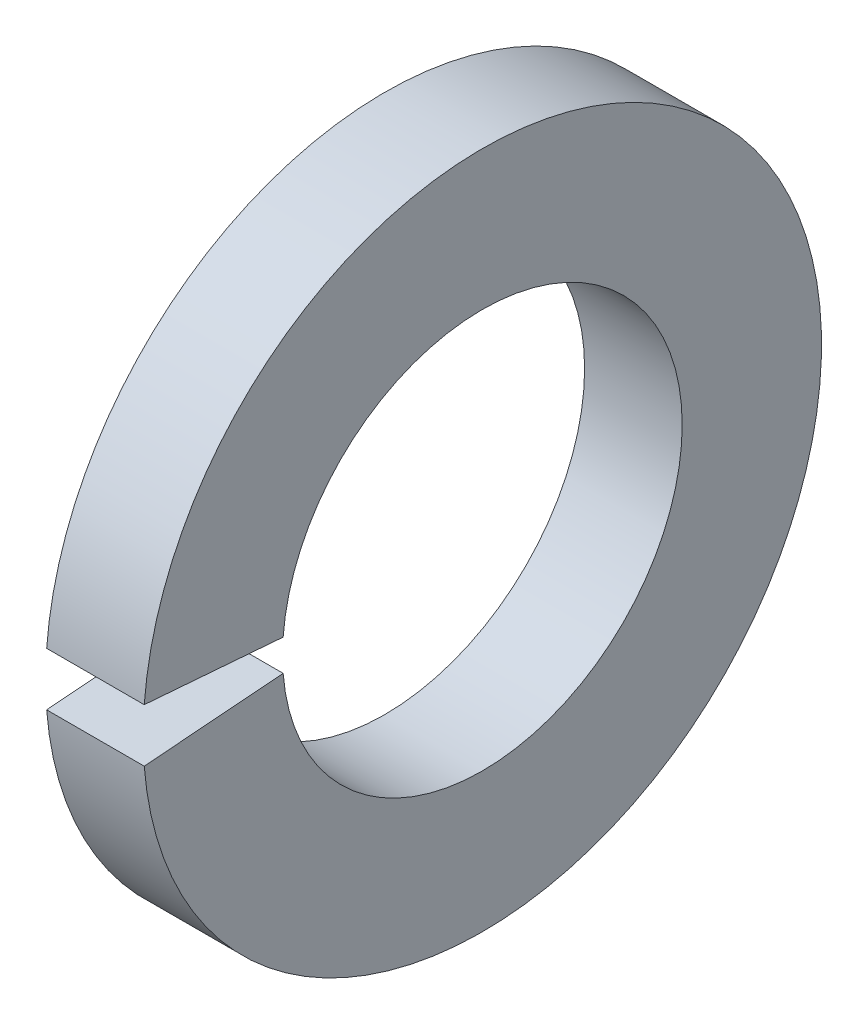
ISO-10303-21;
HEADER;
FILE_DESCRIPTION(('STEP AP214'),'2;1');
FILE_NAME('part.step','',(''),(''),'','','');
FILE_SCHEMA(('AUTOMOTIVE_DESIGN { 1 0 10303 214 1 1 1 1 }'));
ENDSEC;
DATA;
#1=APPLICATION_CONTEXT('core data for automotive mechanical design processes');
#2=APPLICATION_PROTOCOL_DEFINITION('international standard','automotive_design',2000,#1);
#3=PRODUCT_CONTEXT('',#1,'mechanical');
#4=PRODUCT('Part','Part','',(#3));
#5=PRODUCT_RELATED_PRODUCT_CATEGORY('part','',(#4));
#6=PRODUCT_DEFINITION_FORMATION('','',#4);
#7=PRODUCT_DEFINITION_CONTEXT('part definition',#1,'design');
#8=PRODUCT_DEFINITION('design','',#6,#7);
#9=PRODUCT_DEFINITION_SHAPE('','',#8);
#10=(LENGTH_UNIT() NAMED_UNIT(*) SI_UNIT(.MILLI.,.METRE.));
#11=(NAMED_UNIT(*) PLANE_ANGLE_UNIT() SI_UNIT($,.RADIAN.));
#12=(NAMED_UNIT(*) SI_UNIT($,.STERADIAN.) SOLID_ANGLE_UNIT());
#13=UNCERTAINTY_MEASURE_WITH_UNIT(LENGTH_MEASURE(1.E-05),#10,'distance_accuracy_value','');
#14=(GEOMETRIC_REPRESENTATION_CONTEXT(3) GLOBAL_UNCERTAINTY_ASSIGNED_CONTEXT((#13)) GLOBAL_UNIT_ASSIGNED_CONTEXT((#10,
#11,#12)) REPRESENTATION_CONTEXT('',''));
#15=CARTESIAN_POINT('',(0.,0.,0.));
#16=DIRECTION('',(0.,0.,1.));
#17=DIRECTION('',(1.,0.,0.));
#18=AXIS2_PLACEMENT_3D('',#15,#16,#17);
#19=CARTESIAN_POINT('',(-34.9249999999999,0.,0.));
#20=DIRECTION('',(-1.,0.,0.));
#21=DIRECTION('',(0.,0.,1.));
#22=AXIS2_PLACEMENT_3D('',#19,#20,#21);
#23=CYLINDRICAL_SURFACE('',#22,6.5024);
#24=CARTESIAN_POINT('',(0.,0.,0.));
#25=DIRECTION('',(-1.,0.,0.));
#26=DIRECTION('',(0.,0.,1.));
#27=AXIS2_PLACEMENT_3D('',#24,#25,#26);
#28=CIRCLE('',#27,6.5024);
#29=CARTESIAN_POINT('',(0.,0.510172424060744,6.48235527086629));
#30=VERTEX_POINT('',#29);
#31=CARTESIAN_POINT('',(0.,-0.510172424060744,6.48235527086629));
#32=VERTEX_POINT('',#31);
#33=EDGE_CURVE('E81',#30,#32,#28,.T.);
#34=ORIENTED_EDGE('',*,*,#33,.F.);
#35=DIRECTION('',(-1.,0.,0.));
#36=VECTOR('',#35,1.);
#37=CARTESIAN_POINT('',(-34.9249999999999,0.510172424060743,6.48235527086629));
#38=LINE('',#37,#36);
#39=CARTESIAN_POINT('',(-3.175,0.510172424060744,6.48235527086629));
#40=VERTEX_POINT('',#39);
#41=EDGE_CURVE('E95',#30,#40,#38,.T.);
#42=ORIENTED_EDGE('',*,*,#41,.T.);
#43=CARTESIAN_POINT('',(-3.175,0.,0.));
#44=DIRECTION('',(-1.,0.,0.));
#45=DIRECTION('',(0.,0.,1.));
#46=AXIS2_PLACEMENT_3D('',#43,#44,#45);
#47=CIRCLE('',#46,6.5024);
#48=CARTESIAN_POINT('',(-3.175,-0.510172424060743,6.48235527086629));
#49=VERTEX_POINT('',#48);
#50=EDGE_CURVE('E83',#40,#49,#47,.T.);
#51=ORIENTED_EDGE('',*,*,#50,.T.);
#52=DIRECTION('',(-1.,0.,0.));
#53=VECTOR('',#52,1.);
#54=CARTESIAN_POINT('',(-34.9249999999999,-0.510172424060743,6.48235527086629));
#55=LINE('',#54,#53);
#56=EDGE_CURVE('E51',#32,#49,#55,.T.);
#57=ORIENTED_EDGE('',*,*,#56,.F.);
#58=EDGE_LOOP('',(#34,#42,#51,#57));
#59=FACE_BOUND('',#58,.T.);
#60=ADVANCED_FACE('F30',(#59),#23,.F.);
#61=CARTESIAN_POINT('',(0.,6.5024,0.));
#62=DIRECTION('',(-1.,0.,0.));
#63=DIRECTION('',(0.,0.,1.));
#64=AXIS2_PLACEMENT_3D('',#61,#62,#63);
#65=PLANE('',#64);
#66=CARTESIAN_POINT('',(0.,0.,0.));
#67=DIRECTION('',(-1.,0.,0.));
#68=DIRECTION('',(0.,0.,1.));
#69=AXIS2_PLACEMENT_3D('',#66,#67,#68);
#70=CIRCLE('',#69,11.0363);
#71=CARTESIAN_POINT('',(0.,0.865898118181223,11.0022787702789));
#72=VERTEX_POINT('',#71);
#73=CARTESIAN_POINT('',(0.,-0.865898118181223,11.0022787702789));
#74=VERTEX_POINT('',#73);
#75=EDGE_CURVE('E87',#72,#74,#70,.T.);
#76=ORIENTED_EDGE('',*,*,#75,.F.);
#77=DIRECTION('',(0.,0.0784590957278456,0.996917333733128));
#78=VECTOR('',#77,1.);
#79=CARTESIAN_POINT('',(0.,0.,0.));
#80=LINE('',#79,#78);
#81=EDGE_CURVE('E75',#30,#72,#80,.T.);
#82=ORIENTED_EDGE('',*,*,#81,.F.);
#83=ORIENTED_EDGE('',*,*,#33,.T.);
#84=DIRECTION('',(0.,-0.0784590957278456,0.996917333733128));
#85=VECTOR('',#84,1.);
#86=CARTESIAN_POINT('',(0.,0.,0.));
#87=LINE('',#86,#85);
#88=EDGE_CURVE('E67',#32,#74,#87,.T.);
#89=ORIENTED_EDGE('',*,*,#88,.T.);
#90=EDGE_LOOP('',(#76,#82,#83,#89));
#91=FACE_BOUND('',#90,.T.);
#92=ADVANCED_FACE('F86',(#91),#65,.F.);
#93=CARTESIAN_POINT('',(-34.9249999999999,0.,0.));
#94=DIRECTION('',(-1.,0.,0.));
#95=DIRECTION('',(0.,0.,1.));
#96=AXIS2_PLACEMENT_3D('',#93,#94,#95);
#97=CYLINDRICAL_SURFACE('',#96,11.0363);
#98=CARTESIAN_POINT('',(-3.175,0.,0.));
#99=DIRECTION('',(-1.,0.,0.));
#100=DIRECTION('',(0.,0.,1.));
#101=AXIS2_PLACEMENT_3D('',#98,#99,#100);
#102=CIRCLE('',#101,11.0363);
#103=CARTESIAN_POINT('',(-3.175,0.865898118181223,11.0022787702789));
#104=VERTEX_POINT('',#103);
#105=CARTESIAN_POINT('',(-3.175,-0.865898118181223,11.0022787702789));
#106=VERTEX_POINT('',#105);
#107=EDGE_CURVE('E89',#104,#106,#102,.T.);
#108=ORIENTED_EDGE('',*,*,#107,.F.);
#109=DIRECTION('',(-1.,0.,0.));
#110=VECTOR('',#109,1.);
#111=CARTESIAN_POINT('',(-34.9249999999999,0.865898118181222,11.0022787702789));
#112=LINE('',#111,#110);
#113=EDGE_CURVE('E44',#104,#72,#112,.F.);
#114=ORIENTED_EDGE('',*,*,#113,.T.);
#115=ORIENTED_EDGE('',*,*,#75,.T.);
#116=DIRECTION('',(-1.,0.,0.));
#117=VECTOR('',#116,1.);
#118=CARTESIAN_POINT('',(-34.9249999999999,-0.865898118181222,11.0022787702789));
#119=LINE('',#118,#117);
#120=EDGE_CURVE('E70',#106,#74,#119,.F.);
#121=ORIENTED_EDGE('',*,*,#120,.F.);
#122=EDGE_LOOP('',(#108,#114,#115,#121));
#123=FACE_BOUND('',#122,.T.);
#124=ADVANCED_FACE('F102',(#123),#97,.T.);
#125=CARTESIAN_POINT('',(-3.175,11.0363,0.));
#126=DIRECTION('',(1.,0.,0.));
#127=DIRECTION('',(0.,0.,-1.));
#128=AXIS2_PLACEMENT_3D('',#125,#126,#127);
#129=PLANE('',#128);
#130=ORIENTED_EDGE('',*,*,#50,.F.);
#131=DIRECTION('',(0.,0.0784590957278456,0.996917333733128));
#132=VECTOR('',#131,1.);
#133=CARTESIAN_POINT('',(-3.175,0.0679375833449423,0.863228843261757));
#134=LINE('',#133,#132);
#135=EDGE_CURVE('E11',#40,#104,#134,.T.);
#136=ORIENTED_EDGE('',*,*,#135,.T.);
#137=ORIENTED_EDGE('',*,*,#107,.T.);
#138=DIRECTION('',(0.,-0.0784590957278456,0.996917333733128));
#139=VECTOR('',#138,1.);
#140=CARTESIAN_POINT('',(-3.175,0.0679375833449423,-0.863228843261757));
#141=LINE('',#140,#139);
#142=EDGE_CURVE('E37',#49,#106,#141,.T.);
#143=ORIENTED_EDGE('',*,*,#142,.F.);
#144=EDGE_LOOP('',(#130,#136,#137,#143));
#145=FACE_BOUND('',#144,.T.);
#146=ADVANCED_FACE('F104',(#145),#129,.F.);
#147=CARTESIAN_POINT('',(-3.175,0.,0.));
#148=DIRECTION('',(0.,0.996917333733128,0.0784590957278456));
#149=DIRECTION('',(0.,-0.0784590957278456,0.996917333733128));
#150=AXIS2_PLACEMENT_3D('',#147,#148,#149);
#151=PLANE('',#150);
#152=ORIENTED_EDGE('',*,*,#56,.T.);
#153=ORIENTED_EDGE('',*,*,#142,.T.);
#154=ORIENTED_EDGE('',*,*,#120,.T.);
#155=ORIENTED_EDGE('',*,*,#88,.F.);
#156=EDGE_LOOP('',(#152,#153,#154,#155));
#157=FACE_BOUND('',#156,.T.);
#158=ADVANCED_FACE('F68',(#157),#151,.T.);
#159=CARTESIAN_POINT('',(-3.175,0.,0.));
#160=DIRECTION('',(0.,0.996917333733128,-0.0784590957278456));
#161=DIRECTION('',(0.,0.0784590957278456,0.996917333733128));
#162=AXIS2_PLACEMENT_3D('',#159,#160,#161);
#163=PLANE('',#162);
#164=ORIENTED_EDGE('',*,*,#81,.T.);
#165=ORIENTED_EDGE('',*,*,#113,.F.);
#166=ORIENTED_EDGE('',*,*,#135,.F.);
#167=ORIENTED_EDGE('',*,*,#41,.F.);
#168=EDGE_LOOP('',(#164,#165,#166,#167));
#169=FACE_BOUND('',#168,.T.);
#170=ADVANCED_FACE('F99',(#169),#163,.F.);
#171=CLOSED_SHELL('',(#60,#92,#124,#146,#158,#170));
#172=MANIFOLD_SOLID_BREP('B2',#171);
#173=ADVANCED_BREP_SHAPE_REPRESENTATION('',(#18,#172),#14);
#174=SHAPE_DEFINITION_REPRESENTATION(#9,#173);
ENDSEC;
END-ISO-10303-21;
